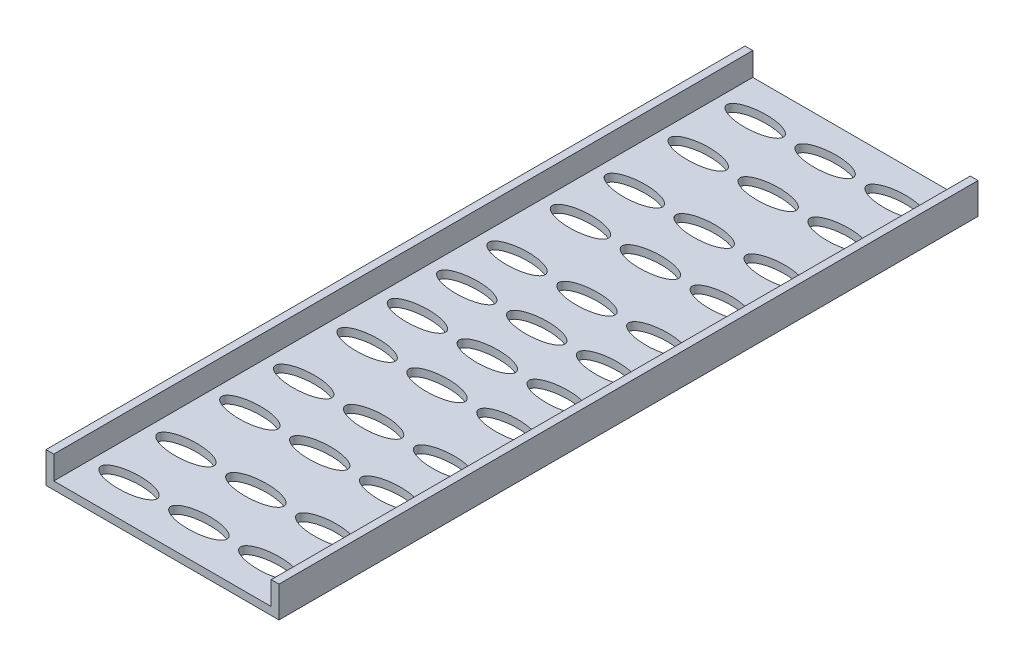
from build123d import *

# Parameters (mm, degrees)
ESQUISSE2_W                = 30
ESQUISSE2_H                = 90
BOSS_EXTRU_1_DEPTH         = 1
ESQUISSE1_RX               = 3.63321962
ESQUISSE1_RY               = 1.386837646
ENL_V_MAT_EXTRU_3_DEPTH    = 92.246917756
SYM_TRIE2_COPY_1_SKETCH_RX = 3.63321962
SYM_TRIE2_COPY_1_SKETCH_RY = 1.386837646
SYM_TRIE2_COPY_1_DEPTH     = 92.246917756
ESQUISSE3_W                = 1
ESQUISSE3_H                = 90
BOSS_EXTRU_2_DEPTH         = 3


with BuildPart() as part:
    # Esquisse2 → Boss.-Extru.1 (new body)
    with BuildSketch(Plane(origin=(0, 0, 0), x_dir=(1, 0, 0), z_dir=(0, 1, 0))):
        with Locations((0, 45)):
            Rectangle(ESQUISSE2_W, ESQUISSE2_H)
    extrude(amount=BOSS_EXTRU_1_DEPTH)

    # Esquisse1 → Enl_v. mat.-Extru.3 (cut, through all)
    with BuildSketch(Plane(origin=(0, 0, 0), x_dir=(1, 0, 0), z_dir=(0, 1, 0))):
        with BuildLine():
            add(Edge.make_bspline(
                [(0, 18.860724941), (3.63321962, 18.860724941), (3.63321962, 20.247562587), (3.63321962, 21.634400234), (0, 21.634400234)],
                knots=[4.71238898, 4.71238898, 4.71238898, 6.283185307, 6.283185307, 7.853981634, 7.853981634, 7.853981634], degree=2, weights=[1, 0.707106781, 1, 0.707106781, 1]))
            Line((0, 21.634400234), (0, 18.860724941))
        make_face()
        with BuildLine():
            add(Edge.make_bspline(
                [(0, 10.630880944), (3.63321962, 10.630880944), (3.63321962, 12.01771859), (3.63321962, 13.404556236), (0, 13.404556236)],
                knots=[4.71238898, 4.71238898, 4.71238898, 6.283185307, 6.283185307, 7.853981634, 7.853981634, 7.853981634], degree=2, weights=[1, 0.707106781, 1, 0.707106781, 1]))
            Line((0, 13.404556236), (0, 10.630880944))
        make_face()
        with BuildLine():
            add(Edge.make_bspline(
                [(0, 3.297324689), (3.63321962, 3.297324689), (3.63321962, 4.684162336), (3.63321962, 6.070999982), (0, 6.070999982)],
                knots=[4.71238898, 4.71238898, 4.71238898, 6.283185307, 6.283185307, 7.853981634, 7.853981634, 7.853981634], degree=2, weights=[1, 0.707106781, 1, 0.707106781, 1]))
            Line((0, 6.070999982), (0, 3.297324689))
        make_face()
        with BuildLine():
            add(Edge.make_bspline(
                [(0, 25.794913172), (3.63321962, 25.794913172), (3.63321962, 27.181750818), (3.63321962, 28.568588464), (0, 28.568588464)],
                knots=[4.71238898, 4.71238898, 4.71238898, 6.283185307, 6.283185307, 7.853981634, 7.853981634, 7.853981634], degree=2, weights=[1, 0.707106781, 1, 0.707106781, 1]))
            Line((0, 28.568588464), (0, 25.794913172))
        make_face()
        with BuildLine():
            add(Edge.make_bspline(
                [(0, 33.961845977), (3.63321962, 33.961845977), (3.63321962, 35.348683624), (3.63321962, 36.73552127), (0, 36.73552127)],
                knots=[4.71238898, 4.71238898, 4.71238898, 6.283185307, 6.283185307, 7.853981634, 7.853981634, 7.853981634], degree=2, weights=[1, 0.707106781, 1, 0.707106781, 1]))
            Line((0, 36.73552127), (0, 33.961845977))
        make_face()
        with Locations(Location((9, 41.820592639), (0, 0, 180))):
            Ellipse(ESQUISSE1_RX, ESQUISSE1_RY)
        with Locations(Location((9, 35.348683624), (0, 0, 180))):
            Ellipse(ESQUISSE1_RX, ESQUISSE1_RY)
        with Locations(Location((9, 27.181750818), (0, 0, 180))):
            Ellipse(ESQUISSE1_RX, ESQUISSE1_RY)
        with Locations(Location((9, 20.247562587), (0, 0, 180))):
            Ellipse(ESQUISSE1_RX, ESQUISSE1_RY)
        with Locations(Location((9, 4.684162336), (0, 0, 180))):
            Ellipse(ESQUISSE1_RX, ESQUISSE1_RY)
        with BuildLine():
            add(Edge.make_bspline(
                [(0, 40.433754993), (3.63321962, 40.433754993), (3.63321962, 41.820592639), (3.63321962, 43.207430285), (0, 43.207430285)],
                knots=[4.71238898, 4.71238898, 4.71238898, 6.283185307, 6.283185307, 7.853981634, 7.853981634, 7.853981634], degree=2, weights=[1, 0.707106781, 1, 0.707106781, 1]))
            Line((0, 43.207430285), (0, 40.433754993))
        make_face()
        with Locations(Location((9, 12.01771859), (0, 0, 180))):
            Ellipse(ESQUISSE1_RX, ESQUISSE1_RY)
    enl_v_mat_extru_3 = extrude(amount=ENL_V_MAT_EXTRU_3_DEPTH, mode=Mode.SUBTRACT)

    # Sym_trie1: Enl_v. mat.-Extru.3 across plane
    add(enl_v_mat_extru_3.mirror(Plane(origin=(0, 0, 0), x_dir=(0, 0, 1), z_dir=(1, 0, 0))), mode=Mode.SUBTRACT)

    # Sym_trie2: Enl_v. mat.-Extru.3 across plane
    add(enl_v_mat_extru_3.mirror(Plane.XY.offset(-45)), mode=Mode.SUBTRACT)

    # Sym_trie2 copy 1 sketch → Sym_trie2 copy 1 (cut, through all)
    with BuildSketch(Plane(origin=(0, 0, -90), x_dir=(-1, 0, 0), z_dir=(0, 1, 0))):
        with BuildLine():
            add(Edge.make_bspline(
                [(0, 18.860724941), (3.63321962, 18.860724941), (3.63321962, 20.247562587), (3.63321962, 21.634400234), (0, 21.634400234)],
                knots=[4.71238898, 4.71238898, 4.71238898, 6.283185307, 6.283185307, 7.853981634, 7.853981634, 7.853981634], degree=2, weights=[1, 0.707106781, 1, 0.707106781, 1]))
            Line((0, 21.634400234), (0, 18.860724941))
        make_face()
        with BuildLine():
            add(Edge.make_bspline(
                [(0, 10.630880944), (3.63321962, 10.630880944), (3.63321962, 12.01771859), (3.63321962, 13.404556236), (0, 13.404556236)],
                knots=[4.71238898, 4.71238898, 4.71238898, 6.283185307, 6.283185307, 7.853981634, 7.853981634, 7.853981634], degree=2, weights=[1, 0.707106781, 1, 0.707106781, 1]))
            Line((0, 13.404556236), (0, 10.630880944))
        make_face()
        with BuildLine():
            add(Edge.make_bspline(
                [(0, 3.297324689), (3.63321962, 3.297324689), (3.63321962, 4.684162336), (3.63321962, 6.070999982), (0, 6.070999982)],
                knots=[4.71238898, 4.71238898, 4.71238898, 6.283185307, 6.283185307, 7.853981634, 7.853981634, 7.853981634], degree=2, weights=[1, 0.707106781, 1, 0.707106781, 1]))
            Line((0, 6.070999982), (0, 3.297324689))
        make_face()
        with BuildLine():
            add(Edge.make_bspline(
                [(0, 25.794913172), (3.63321962, 25.794913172), (3.63321962, 27.181750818), (3.63321962, 28.568588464), (0, 28.568588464)],
                knots=[4.71238898, 4.71238898, 4.71238898, 6.283185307, 6.283185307, 7.853981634, 7.853981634, 7.853981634], degree=2, weights=[1, 0.707106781, 1, 0.707106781, 1]))
            Line((0, 28.568588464), (0, 25.794913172))
        make_face()
        with BuildLine():
            add(Edge.make_bspline(
                [(0, 33.961845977), (3.63321962, 33.961845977), (3.63321962, 35.348683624), (3.63321962, 36.73552127), (0, 36.73552127)],
                knots=[4.71238898, 4.71238898, 4.71238898, 6.283185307, 6.283185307, 7.853981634, 7.853981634, 7.853981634], degree=2, weights=[1, 0.707106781, 1, 0.707106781, 1]))
            Line((0, 36.73552127), (0, 33.961845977))
        make_face()
        with Locations(Location((9, 41.820592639), (0, 0, 180))):
            Ellipse(SYM_TRIE2_COPY_1_SKETCH_RX, SYM_TRIE2_COPY_1_SKETCH_RY)
        with Locations(Location((9, 35.348683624), (0, 0, 180))):
            Ellipse(SYM_TRIE2_COPY_1_SKETCH_RX, SYM_TRIE2_COPY_1_SKETCH_RY)
        with Locations(Location((9, 27.181750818), (0, 0, 180))):
            Ellipse(SYM_TRIE2_COPY_1_SKETCH_RX, SYM_TRIE2_COPY_1_SKETCH_RY)
        with Locations(Location((9, 20.247562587), (0, 0, 180))):
            Ellipse(SYM_TRIE2_COPY_1_SKETCH_RX, SYM_TRIE2_COPY_1_SKETCH_RY)
        with Locations(Location((9, 4.684162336), (0, 0, 180))):
            Ellipse(SYM_TRIE2_COPY_1_SKETCH_RX, SYM_TRIE2_COPY_1_SKETCH_RY)
        with BuildLine():
            add(Edge.make_bspline(
                [(0, 40.433754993), (3.63321962, 40.433754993), (3.63321962, 41.820592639), (3.63321962, 43.207430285), (0, 43.207430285)],
                knots=[4.71238898, 4.71238898, 4.71238898, 6.283185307, 6.283185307, 7.853981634, 7.853981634, 7.853981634], degree=2, weights=[1, 0.707106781, 1, 0.707106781, 1]))
            Line((0, 43.207430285), (0, 40.433754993))
        make_face()
        with Locations(Location((9, 12.01771859), (0, 0, 180))):
            Ellipse(SYM_TRIE2_COPY_1_SKETCH_RX, SYM_TRIE2_COPY_1_SKETCH_RY)
    extrude(amount=SYM_TRIE2_COPY_1_DEPTH, mode=Mode.SUBTRACT)

    # Esquisse3 → Boss.-Extru.2 (add)
    with BuildSketch(Plane(origin=(0, 1, 0), x_dir=(1, 0, 0), z_dir=(0, 1, 0))):
        with Locations((-14.5, 45)):
            Rectangle(ESQUISSE3_W, ESQUISSE3_H)
        with Locations((14.5, 45)):
            Rectangle(ESQUISSE3_W, ESQUISSE3_H)
    extrude(amount=BOSS_EXTRU_2_DEPTH)


solid = part.part
